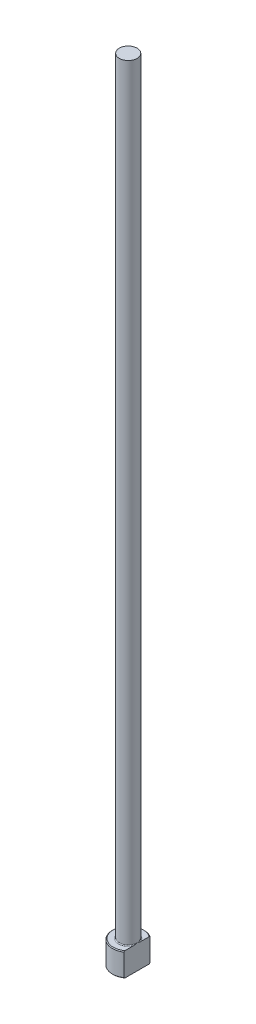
from build123d import *
from build123d.topology import SkipClean

# Parameters (mm, degrees)
CHAMFER1_SIZE    = 0.2
FILLET1_R        = 0.2
KEYED_HEAD_DEPTH = 201.079984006


with BuildPart() as part:
    # Sketch1 → Revolve1 (revolve)
    with BuildSketch(Plane.XY, mode=Mode.PRIVATE) as revolve1_sk:
        Polygon((0, 0), (-4, 0), (-4, 6), (-2.25, 6), (-2.25, 200), (0, 200), align=None)
    revolve(revolve1_sk.sketch.rotate(Axis((0, 259.958771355, 0), (0, -1, 0)), 270), axis=Axis((0, 259.958771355, 0), (0, -1, 0)))

    # Chamfer1
    chamfer1_edges = [part.edges().sort_by_distance(p)[0] for p in [
        (0, 6, -4),
        (0, 0, -4),
    ]]
    chamfer(chamfer1_edges, length=CHAMFER1_SIZE)

    # Fillet1
    fillet1_edges = [part.edges().sort_by_distance(p)[0] for p in [
        (0, 6, -2.25),
    ]]
    fillet(fillet1_edges, radius=FILLET1_R)

    # Sketch2 → KEYED HEAD (cut, through all)
    with SkipClean():  # the faces are left unmerged after this step: merging them gives an invalid solid
        with BuildSketch(Plane(origin=(0, 0, 0), x_dir=(1, 0, 0), z_dir=(0, 1, 0))):
            with BuildLine():
                Line((2.25, -3.307189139), (2.25, 3.307189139))
                ThreePointArc((2.25, 3.307189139), (4, 0), (2.25, -3.307189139))
            make_face()
        extrude(amount=KEYED_HEAD_DEPTH, mode=Mode.SUBTRACT)


solid = part.part
